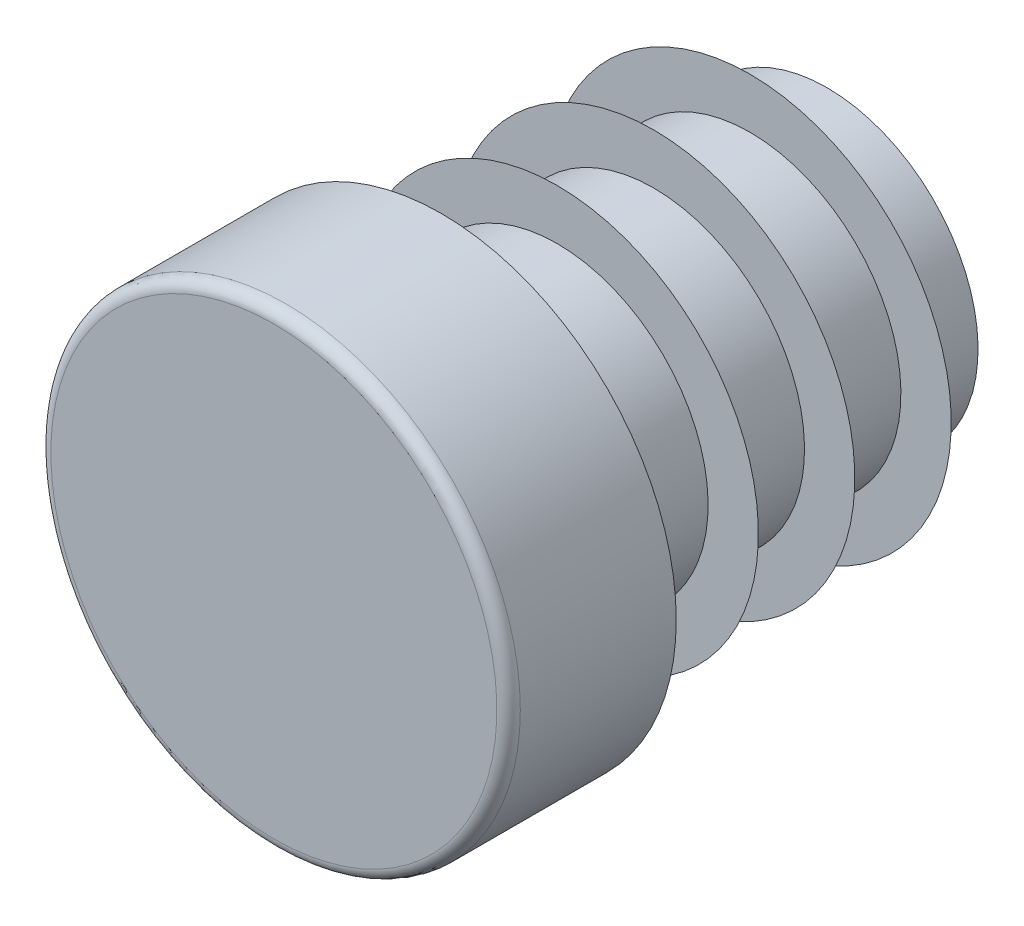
ISO-10303-21;
HEADER;
FILE_DESCRIPTION(('STEP AP214'),'2;1');
FILE_NAME('part.step','',(''),(''),'','','');
FILE_SCHEMA(('AUTOMOTIVE_DESIGN { 1 0 10303 214 1 1 1 1 }'));
ENDSEC;
DATA;
#1=APPLICATION_CONTEXT('core data for automotive mechanical design processes');
#2=APPLICATION_PROTOCOL_DEFINITION('international standard','automotive_design',2000,#1);
#3=PRODUCT_CONTEXT('',#1,'mechanical');
#4=PRODUCT('Part','Part','',(#3));
#5=PRODUCT_RELATED_PRODUCT_CATEGORY('part','',(#4));
#6=PRODUCT_DEFINITION_FORMATION('','',#4);
#7=PRODUCT_DEFINITION_CONTEXT('part definition',#1,'design');
#8=PRODUCT_DEFINITION('design','',#6,#7);
#9=PRODUCT_DEFINITION_SHAPE('','',#8);
#10=(LENGTH_UNIT() NAMED_UNIT(*) SI_UNIT(.MILLI.,.METRE.));
#11=(NAMED_UNIT(*) PLANE_ANGLE_UNIT() SI_UNIT($,.RADIAN.));
#12=(NAMED_UNIT(*) SI_UNIT($,.STERADIAN.) SOLID_ANGLE_UNIT());
#13=UNCERTAINTY_MEASURE_WITH_UNIT(LENGTH_MEASURE(1.E-05),#10,'distance_accuracy_value','');
#14=(GEOMETRIC_REPRESENTATION_CONTEXT(3) GLOBAL_UNCERTAINTY_ASSIGNED_CONTEXT((#13)) GLOBAL_UNIT_ASSIGNED_CONTEXT((#10,
#11,#12)) REPRESENTATION_CONTEXT('',''));
#15=CARTESIAN_POINT('',(0.,0.,0.));
#16=DIRECTION('',(0.,0.,1.));
#17=DIRECTION('',(1.,0.,0.));
#18=AXIS2_PLACEMENT_3D('',#15,#16,#17);
#19=CARTESIAN_POINT('',(0.,0.,5.));
#20=DIRECTION('',(0.,0.,-1.));
#21=DIRECTION('',(0.,1.,0.));
#22=AXIS2_PLACEMENT_3D('',#19,#20,#21);
#23=PLANE('',#22);
#24=CARTESIAN_POINT('',(0.,0.,5.));
#25=DIRECTION('',(0.,0.,-1.));
#26=DIRECTION('',(0.,1.,0.));
#27=AXIS2_PLACEMENT_3D('',#24,#25,#26);
#28=CIRCLE('',#27,6.65);
#29=CARTESIAN_POINT('',(0.,6.65,5.));
#30=VERTEX_POINT('',#29);
#31=EDGE_CURVE('E8',#30,#30,#28,.T.);
#32=ORIENTED_EDGE('',*,*,#31,.F.);
#33=EDGE_LOOP('',(#32));
#34=FACE_BOUND('',#33,.T.);
#35=ADVANCED_FACE('F12',(#34),#23,.F.);
#36=CARTESIAN_POINT('',(0.,0.,4.65));
#37=DIRECTION('',(0.,0.,-1.));
#38=DIRECTION('',(0.,1.,0.));
#39=AXIS2_PLACEMENT_3D('',#36,#37,#38);
#40=TOROIDAL_SURFACE('',#39,6.65,0.35);
#41=ORIENTED_EDGE('',*,*,#31,.T.);
#42=EDGE_LOOP('',(#41));
#43=FACE_BOUND('',#42,.T.);
#44=CARTESIAN_POINT('',(0.,0.,4.65000000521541));
#45=DIRECTION('',(0.,0.,-1.));
#46=DIRECTION('',(0.,1.,0.));
#47=AXIS2_PLACEMENT_3D('',#44,#45,#46);
#48=CIRCLE('',#47,7.);
#49=CARTESIAN_POINT('',(0.,7.,4.65000000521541));
#50=VERTEX_POINT('',#49);
#51=EDGE_CURVE('E18',#50,#50,#48,.T.);
#52=ORIENTED_EDGE('',*,*,#51,.F.);
#53=EDGE_LOOP('',(#52));
#54=FACE_BOUND('',#53,.T.);
#55=ADVANCED_FACE('F159',(#43,#54),#40,.T.);
#56=CARTESIAN_POINT('',(0.,0.,-11.5));
#57=DIRECTION('',(0.,0.,-1.));
#58=DIRECTION('',(0.,1.,0.));
#59=AXIS2_PLACEMENT_3D('',#56,#57,#58);
#60=CYLINDRICAL_SURFACE('',#59,7.);
#61=CARTESIAN_POINT('',(0.,0.,0.));
#62=DIRECTION('',(0.,0.,-1.));
#63=DIRECTION('',(0.,1.,0.));
#64=AXIS2_PLACEMENT_3D('',#61,#62,#63);
#65=CIRCLE('',#64,7.);
#66=CARTESIAN_POINT('',(0.,7.,0.));
#67=VERTEX_POINT('',#66);
#68=EDGE_CURVE('E22',#67,#67,#65,.T.);
#69=ORIENTED_EDGE('',*,*,#68,.F.);
#70=EDGE_LOOP('',(#69));
#71=FACE_BOUND('',#70,.T.);
#72=ORIENTED_EDGE('',*,*,#51,.T.);
#73=EDGE_LOOP('',(#72));
#74=FACE_BOUND('',#73,.T.);
#75=ADVANCED_FACE('F154',(#71,#74),#60,.T.);
#76=CARTESIAN_POINT('',(7.,0.,0.));
#77=DIRECTION('',(0.,0.,1.));
#78=DIRECTION('',(0.,-1.,0.));
#79=AXIS2_PLACEMENT_3D('',#76,#77,#78);
#80=PLANE('',#79);
#81=CARTESIAN_POINT('',(0.,0.,0.));
#82=DIRECTION('',(0.,0.,-1.));
#83=DIRECTION('',(0.,1.,0.));
#84=AXIS2_PLACEMENT_3D('',#81,#82,#83);
#85=CIRCLE('',#84,4.5);
#86=CARTESIAN_POINT('',(0.,4.5,0.));
#87=VERTEX_POINT('',#86);
#88=EDGE_CURVE('E26',#87,#87,#85,.T.);
#89=ORIENTED_EDGE('',*,*,#88,.F.);
#90=EDGE_LOOP('',(#89));
#91=FACE_BOUND('',#90,.T.);
#92=ORIENTED_EDGE('',*,*,#68,.T.);
#93=EDGE_LOOP('',(#92));
#94=FACE_BOUND('',#93,.T.);
#95=ADVANCED_FACE('F148',(#91,#94),#80,.F.);
#96=CARTESIAN_POINT('',(0.,0.,-11.5));
#97=DIRECTION('',(0.,0.,-1.));
#98=DIRECTION('',(0.,1.,0.));
#99=AXIS2_PLACEMENT_3D('',#96,#97,#98);
#100=CYLINDRICAL_SURFACE('',#99,4.5);
#101=CARTESIAN_POINT('',(0.,0.,-0.575));
#102=DIRECTION('',(0.,0.,-1.));
#103=DIRECTION('',(0.,1.,0.));
#104=AXIS2_PLACEMENT_3D('',#101,#102,#103);
#105=CIRCLE('',#104,4.5);
#106=CARTESIAN_POINT('',(0.,4.5,-0.575));
#107=VERTEX_POINT('',#106);
#108=EDGE_CURVE('E31',#107,#107,#105,.T.);
#109=ORIENTED_EDGE('',*,*,#108,.F.);
#110=EDGE_LOOP('',(#109));
#111=FACE_BOUND('',#110,.T.);
#112=ORIENTED_EDGE('',*,*,#88,.T.);
#113=EDGE_LOOP('',(#112));
#114=FACE_BOUND('',#113,.T.);
#115=ADVANCED_FACE('F142',(#111,#114),#100,.T.);
#116=CARTESIAN_POINT('',(4.5,0.,-0.575));
#117=DIRECTION('',(0.,0.,-1.));
#118=DIRECTION('',(0.,1.,0.));
#119=AXIS2_PLACEMENT_3D('',#116,#117,#118);
#120=PLANE('',#119);
#121=CARTESIAN_POINT('',(0.,0.,-0.575));
#122=DIRECTION('',(0.,0.,-1.));
#123=DIRECTION('',(0.,1.,0.));
#124=AXIS2_PLACEMENT_3D('',#121,#122,#123);
#125=CIRCLE('',#124,6.);
#126=CARTESIAN_POINT('',(0.,6.,-0.575));
#127=VERTEX_POINT('',#126);
#128=EDGE_CURVE('E34',#127,#127,#125,.T.);
#129=ORIENTED_EDGE('',*,*,#128,.F.);
#130=EDGE_LOOP('',(#129));
#131=FACE_BOUND('',#130,.T.);
#132=ORIENTED_EDGE('',*,*,#108,.T.);
#133=EDGE_LOOP('',(#132));
#134=FACE_BOUND('',#133,.T.);
#135=ADVANCED_FACE('F136',(#131,#134),#120,.F.);
#136=CARTESIAN_POINT('',(0.,0.,-0.575));
#137=DIRECTION('',(0.,0.,1.));
#138=DIRECTION('',(0.,-1.,0.));
#139=AXIS2_PLACEMENT_3D('',#136,#137,#138);
#140=CONICAL_SURFACE('',#139,6.,0.959931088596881);
#141=CARTESIAN_POINT('',(0.,0.,-1.62531130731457));
#142=DIRECTION('',(0.,0.,-1.));
#143=DIRECTION('',(0.,1.,0.));
#144=AXIS2_PLACEMENT_3D('',#141,#142,#143);
#145=CIRCLE('',#144,4.5);
#146=CARTESIAN_POINT('',(0.,4.5,-1.62531130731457));
#147=VERTEX_POINT('',#146);
#148=EDGE_CURVE('E37',#147,#147,#145,.T.);
#149=ORIENTED_EDGE('',*,*,#148,.F.);
#150=EDGE_LOOP('',(#149));
#151=FACE_BOUND('',#150,.T.);
#152=ORIENTED_EDGE('',*,*,#128,.T.);
#153=EDGE_LOOP('',(#152));
#154=FACE_BOUND('',#153,.T.);
#155=ADVANCED_FACE('F130',(#151,#154),#140,.T.);
#156=CARTESIAN_POINT('',(0.,0.,-11.5));
#157=DIRECTION('',(0.,0.,-1.));
#158=DIRECTION('',(0.,1.,0.));
#159=AXIS2_PLACEMENT_3D('',#156,#157,#158);
#160=CYLINDRICAL_SURFACE('',#159,4.5);
#161=CARTESIAN_POINT('',(0.,0.,-3.45));
#162=DIRECTION('',(0.,0.,-1.));
#163=DIRECTION('',(0.,1.,0.));
#164=AXIS2_PLACEMENT_3D('',#161,#162,#163);
#165=CIRCLE('',#164,4.5);
#166=CARTESIAN_POINT('',(0.,4.5,-3.45));
#167=VERTEX_POINT('',#166);
#168=EDGE_CURVE('E40',#167,#167,#165,.T.);
#169=ORIENTED_EDGE('',*,*,#168,.F.);
#170=EDGE_LOOP('',(#169));
#171=FACE_BOUND('',#170,.T.);
#172=ORIENTED_EDGE('',*,*,#148,.T.);
#173=EDGE_LOOP('',(#172));
#174=FACE_BOUND('',#173,.T.);
#175=ADVANCED_FACE('F124',(#171,#174),#160,.T.);
#176=CARTESIAN_POINT('',(4.5,0.,-3.45));
#177=DIRECTION('',(0.,0.,-1.));
#178=DIRECTION('',(0.,1.,0.));
#179=AXIS2_PLACEMENT_3D('',#176,#177,#178);
#180=PLANE('',#179);
#181=CARTESIAN_POINT('',(0.,0.,-3.45));
#182=DIRECTION('',(0.,0.,-1.));
#183=DIRECTION('',(0.,1.,0.));
#184=AXIS2_PLACEMENT_3D('',#181,#182,#183);
#185=CIRCLE('',#184,6.);
#186=CARTESIAN_POINT('',(0.,6.,-3.45));
#187=VERTEX_POINT('',#186);
#188=EDGE_CURVE('E43',#187,#187,#185,.T.);
#189=ORIENTED_EDGE('',*,*,#188,.F.);
#190=EDGE_LOOP('',(#189));
#191=FACE_BOUND('',#190,.T.);
#192=ORIENTED_EDGE('',*,*,#168,.T.);
#193=EDGE_LOOP('',(#192));
#194=FACE_BOUND('',#193,.T.);
#195=ADVANCED_FACE('F118',(#191,#194),#180,.F.);
#196=CARTESIAN_POINT('',(0.,0.,-3.45));
#197=DIRECTION('',(0.,0.,1.));
#198=DIRECTION('',(0.,-1.,0.));
#199=AXIS2_PLACEMENT_3D('',#196,#197,#198);
#200=CONICAL_SURFACE('',#199,6.,0.959931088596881);
#201=CARTESIAN_POINT('',(0.,0.,-4.50031130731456));
#202=DIRECTION('',(0.,0.,-1.));
#203=DIRECTION('',(0.,1.,0.));
#204=AXIS2_PLACEMENT_3D('',#201,#202,#203);
#205=CIRCLE('',#204,4.5);
#206=CARTESIAN_POINT('',(0.,4.5,-4.50031130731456));
#207=VERTEX_POINT('',#206);
#208=EDGE_CURVE('E46',#207,#207,#205,.T.);
#209=ORIENTED_EDGE('',*,*,#208,.F.);
#210=EDGE_LOOP('',(#209));
#211=FACE_BOUND('',#210,.T.);
#212=ORIENTED_EDGE('',*,*,#188,.T.);
#213=EDGE_LOOP('',(#212));
#214=FACE_BOUND('',#213,.T.);
#215=ADVANCED_FACE('F112',(#211,#214),#200,.T.);
#216=CARTESIAN_POINT('',(0.,0.,-11.5));
#217=DIRECTION('',(0.,0.,-1.));
#218=DIRECTION('',(0.,1.,0.));
#219=AXIS2_PLACEMENT_3D('',#216,#217,#218);
#220=CYLINDRICAL_SURFACE('',#219,4.5);
#221=CARTESIAN_POINT('',(0.,0.,-6.325));
#222=DIRECTION('',(0.,0.,-1.));
#223=DIRECTION('',(0.,1.,0.));
#224=AXIS2_PLACEMENT_3D('',#221,#222,#223);
#225=CIRCLE('',#224,4.5);
#226=CARTESIAN_POINT('',(0.,4.5,-6.325));
#227=VERTEX_POINT('',#226);
#228=EDGE_CURVE('E49',#227,#227,#225,.T.);
#229=ORIENTED_EDGE('',*,*,#228,.F.);
#230=EDGE_LOOP('',(#229));
#231=FACE_BOUND('',#230,.T.);
#232=ORIENTED_EDGE('',*,*,#208,.T.);
#233=EDGE_LOOP('',(#232));
#234=FACE_BOUND('',#233,.T.);
#235=ADVANCED_FACE('F106',(#231,#234),#220,.T.);
#236=CARTESIAN_POINT('',(4.5,0.,-6.325));
#237=DIRECTION('',(0.,0.,-1.));
#238=DIRECTION('',(0.,1.,0.));
#239=AXIS2_PLACEMENT_3D('',#236,#237,#238);
#240=PLANE('',#239);
#241=CARTESIAN_POINT('',(0.,0.,-6.325));
#242=DIRECTION('',(0.,0.,-1.));
#243=DIRECTION('',(0.,1.,0.));
#244=AXIS2_PLACEMENT_3D('',#241,#242,#243);
#245=CIRCLE('',#244,6.);
#246=CARTESIAN_POINT('',(0.,6.,-6.325));
#247=VERTEX_POINT('',#246);
#248=EDGE_CURVE('E52',#247,#247,#245,.T.);
#249=ORIENTED_EDGE('',*,*,#248,.F.);
#250=EDGE_LOOP('',(#249));
#251=FACE_BOUND('',#250,.T.);
#252=ORIENTED_EDGE('',*,*,#228,.T.);
#253=EDGE_LOOP('',(#252));
#254=FACE_BOUND('',#253,.T.);
#255=ADVANCED_FACE('F100',(#251,#254),#240,.F.);
#256=CARTESIAN_POINT('',(0.,0.,-6.325));
#257=DIRECTION('',(0.,0.,1.));
#258=DIRECTION('',(0.,-1.,0.));
#259=AXIS2_PLACEMENT_3D('',#256,#257,#258);
#260=CONICAL_SURFACE('',#259,6.,0.959931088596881);
#261=CARTESIAN_POINT('',(0.,0.,-7.37531130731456));
#262=DIRECTION('',(0.,0.,-1.));
#263=DIRECTION('',(0.,1.,0.));
#264=AXIS2_PLACEMENT_3D('',#261,#262,#263);
#265=CIRCLE('',#264,4.5);
#266=CARTESIAN_POINT('',(0.,4.5,-7.37531130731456));
#267=VERTEX_POINT('',#266);
#268=EDGE_CURVE('E55',#267,#267,#265,.T.);
#269=ORIENTED_EDGE('',*,*,#268,.F.);
#270=EDGE_LOOP('',(#269));
#271=FACE_BOUND('',#270,.T.);
#272=ORIENTED_EDGE('',*,*,#248,.T.);
#273=EDGE_LOOP('',(#272));
#274=FACE_BOUND('',#273,.T.);
#275=ADVANCED_FACE('F94',(#271,#274),#260,.T.);
#276=CARTESIAN_POINT('',(0.,0.,-11.5));
#277=DIRECTION('',(0.,0.,-1.));
#278=DIRECTION('',(0.,1.,0.));
#279=AXIS2_PLACEMENT_3D('',#276,#277,#278);
#280=CYLINDRICAL_SURFACE('',#279,4.5);
#281=CARTESIAN_POINT('',(0.,0.,-9.2));
#282=DIRECTION('',(0.,0.,-1.));
#283=DIRECTION('',(0.,1.,0.));
#284=AXIS2_PLACEMENT_3D('',#281,#282,#283);
#285=CIRCLE('',#284,4.5);
#286=CARTESIAN_POINT('',(0.,4.5,-9.2));
#287=VERTEX_POINT('',#286);
#288=EDGE_CURVE('E58',#287,#287,#285,.T.);
#289=ORIENTED_EDGE('',*,*,#288,.F.);
#290=EDGE_LOOP('',(#289));
#291=FACE_BOUND('',#290,.T.);
#292=ORIENTED_EDGE('',*,*,#268,.T.);
#293=EDGE_LOOP('',(#292));
#294=FACE_BOUND('',#293,.T.);
#295=ADVANCED_FACE('F88',(#291,#294),#280,.T.);
#296=CARTESIAN_POINT('',(4.5,0.,-9.2));
#297=DIRECTION('',(0.,0.,-1.));
#298=DIRECTION('',(0.,1.,0.));
#299=AXIS2_PLACEMENT_3D('',#296,#297,#298);
#300=PLANE('',#299);
#301=CARTESIAN_POINT('',(0.,0.,-9.2));
#302=DIRECTION('',(0.,0.,-1.));
#303=DIRECTION('',(0.,1.,0.));
#304=AXIS2_PLACEMENT_3D('',#301,#302,#303);
#305=CIRCLE('',#304,6.);
#306=CARTESIAN_POINT('',(0.,6.,-9.2));
#307=VERTEX_POINT('',#306);
#308=EDGE_CURVE('E61',#307,#307,#305,.T.);
#309=ORIENTED_EDGE('',*,*,#308,.F.);
#310=EDGE_LOOP('',(#309));
#311=FACE_BOUND('',#310,.T.);
#312=ORIENTED_EDGE('',*,*,#288,.T.);
#313=EDGE_LOOP('',(#312));
#314=FACE_BOUND('',#313,.T.);
#315=ADVANCED_FACE('F82',(#311,#314),#300,.F.);
#316=CARTESIAN_POINT('',(0.,0.,-9.2));
#317=DIRECTION('',(0.,0.,1.));
#318=DIRECTION('',(0.,-1.,0.));
#319=AXIS2_PLACEMENT_3D('',#316,#317,#318);
#320=CONICAL_SURFACE('',#319,6.,0.959931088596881);
#321=CARTESIAN_POINT('',(0.,0.,-10.2503113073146));
#322=DIRECTION('',(0.,0.,-1.));
#323=DIRECTION('',(0.,1.,0.));
#324=AXIS2_PLACEMENT_3D('',#321,#322,#323);
#325=CIRCLE('',#324,4.5);
#326=CARTESIAN_POINT('',(0.,4.5,-10.2503113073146));
#327=VERTEX_POINT('',#326);
#328=EDGE_CURVE('E64',#327,#327,#325,.T.);
#329=ORIENTED_EDGE('',*,*,#328,.F.);
#330=EDGE_LOOP('',(#329));
#331=FACE_BOUND('',#330,.T.);
#332=ORIENTED_EDGE('',*,*,#308,.T.);
#333=EDGE_LOOP('',(#332));
#334=FACE_BOUND('',#333,.T.);
#335=ADVANCED_FACE('F76',(#331,#334),#320,.T.);
#336=CARTESIAN_POINT('',(0.,0.,-11.5));
#337=DIRECTION('',(0.,0.,-1.));
#338=DIRECTION('',(0.,1.,0.));
#339=AXIS2_PLACEMENT_3D('',#336,#337,#338);
#340=CYLINDRICAL_SURFACE('',#339,4.5);
#341=CARTESIAN_POINT('',(0.,0.,-11.5));
#342=DIRECTION('',(0.,0.,-1.));
#343=DIRECTION('',(0.,1.,0.));
#344=AXIS2_PLACEMENT_3D('',#341,#342,#343);
#345=CIRCLE('',#344,4.5);
#346=CARTESIAN_POINT('',(0.,4.5,-11.5));
#347=VERTEX_POINT('',#346);
#348=EDGE_CURVE('E67',#347,#347,#345,.T.);
#349=ORIENTED_EDGE('',*,*,#348,.F.);
#350=EDGE_LOOP('',(#349));
#351=FACE_BOUND('',#350,.T.);
#352=ORIENTED_EDGE('',*,*,#328,.T.);
#353=EDGE_LOOP('',(#352));
#354=FACE_BOUND('',#353,.T.);
#355=ADVANCED_FACE('F73',(#351,#354),#340,.T.);
#356=CARTESIAN_POINT('',(4.5,0.,-11.5));
#357=DIRECTION('',(0.,0.,1.));
#358=DIRECTION('',(0.,-1.,0.));
#359=AXIS2_PLACEMENT_3D('',#356,#357,#358);
#360=PLANE('',#359);
#361=ORIENTED_EDGE('',*,*,#348,.T.);
#362=EDGE_LOOP('',(#361));
#363=FACE_BOUND('',#362,.T.);
#364=ADVANCED_FACE('F71',(#363),#360,.F.);
#365=CLOSED_SHELL('',(#35,#55,#75,#95,#115,#135,#155,#175,#195,#215,#235,#255,#275,#295,#315,
#335,#355,#364));
#366=MANIFOLD_SOLID_BREP('B1',#365);
#367=ADVANCED_BREP_SHAPE_REPRESENTATION('',(#18,#366),#14);
#368=SHAPE_DEFINITION_REPRESENTATION(#9,#367);
ENDSEC;
END-ISO-10303-21;
